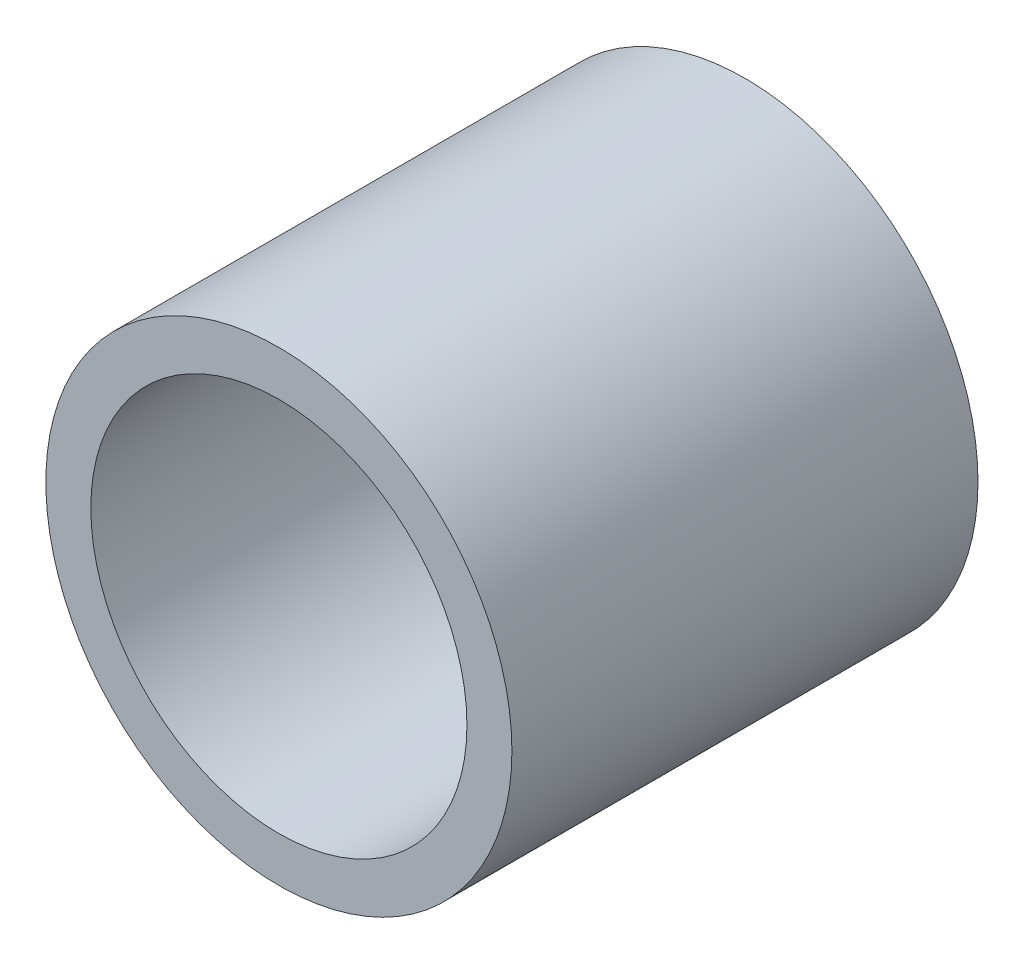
from build123d import *

# Parameters (mm, degrees)
SKETCH_1_R      = 5
SKETCH_1_R_2    = 4.035
EXTRUDE_1_DEPTH = 10


with BuildPart() as part:
    # Sketch 1 → Extrude 1 (new body)
    with BuildSketch(Plane.XY):
        Circle(SKETCH_1_R)
        Circle(SKETCH_1_R_2, mode=Mode.SUBTRACT)
    extrude(amount=EXTRUDE_1_DEPTH)


solid = part.part
